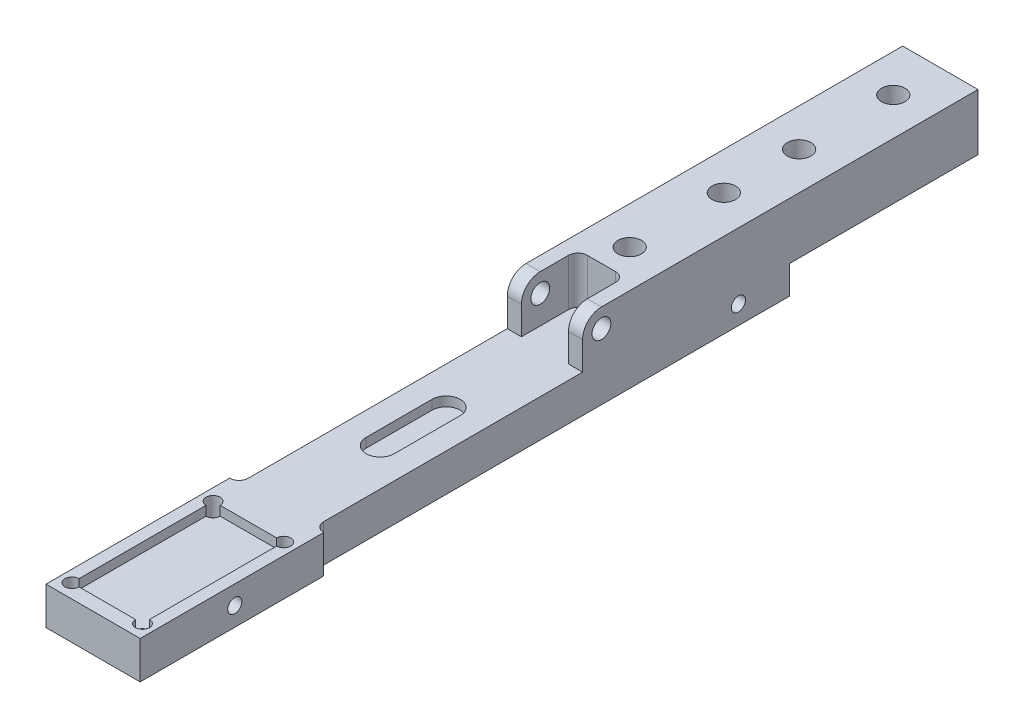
ISO-10303-21;
HEADER;
FILE_DESCRIPTION(('STEP AP214'),'2;1');
FILE_NAME('part.step','',(''),(''),'','','');
FILE_SCHEMA(('AUTOMOTIVE_DESIGN { 1 0 10303 214 1 1 1 1 }'));
ENDSEC;
DATA;
#1=APPLICATION_CONTEXT('core data for automotive mechanical design processes');
#2=APPLICATION_PROTOCOL_DEFINITION('international standard','automotive_design',2000,#1);
#3=PRODUCT_CONTEXT('',#1,'mechanical');
#4=PRODUCT('Part','Part','',(#3));
#5=PRODUCT_RELATED_PRODUCT_CATEGORY('part','',(#4));
#6=PRODUCT_DEFINITION_FORMATION('','',#4);
#7=PRODUCT_DEFINITION_CONTEXT('part definition',#1,'design');
#8=PRODUCT_DEFINITION('design','',#6,#7);
#9=PRODUCT_DEFINITION_SHAPE('','',#8);
#10=(LENGTH_UNIT() NAMED_UNIT(*) SI_UNIT(.MILLI.,.METRE.));
#11=(NAMED_UNIT(*) PLANE_ANGLE_UNIT() SI_UNIT($,.RADIAN.));
#12=(NAMED_UNIT(*) SI_UNIT($,.STERADIAN.) SOLID_ANGLE_UNIT());
#13=UNCERTAINTY_MEASURE_WITH_UNIT(LENGTH_MEASURE(1.E-05),#10,'distance_accuracy_value','');
#14=(GEOMETRIC_REPRESENTATION_CONTEXT(3) GLOBAL_UNCERTAINTY_ASSIGNED_CONTEXT((#13)) GLOBAL_UNIT_ASSIGNED_CONTEXT((#10,
#11,#12)) REPRESENTATION_CONTEXT('',''));
#15=CARTESIAN_POINT('',(0.,0.,0.));
#16=DIRECTION('',(0.,0.,1.));
#17=DIRECTION('',(1.,0.,0.));
#18=AXIS2_PLACEMENT_3D('',#15,#16,#17);
#19=CARTESIAN_POINT('',(10.,-8.,-40.));
#20=DIRECTION('',(0.,0.,1.));
#21=DIRECTION('',(1.,0.,0.));
#22=AXIS2_PLACEMENT_3D('',#19,#20,#21);
#23=PLANE('',#22);
#24=DIRECTION('',(-1.,0.,0.));
#25=VECTOR('',#24,1.);
#26=CARTESIAN_POINT('',(-8.,-8.,-40.));
#27=LINE('',#26,#25);
#28=CARTESIAN_POINT('',(8.,-8.,-40.));
#29=VERTEX_POINT('',#28);
#30=CARTESIAN_POINT('',(-8.,-8.,-40.));
#31=VERTEX_POINT('',#30);
#32=EDGE_CURVE('E345',#29,#31,#27,.T.);
#33=ORIENTED_EDGE('',*,*,#32,.F.);
#34=DIRECTION('',(0.,-1.,0.));
#35=VECTOR('',#34,1.);
#36=CARTESIAN_POINT('',(8.,-8.,-40.));
#37=LINE('',#36,#35);
#38=CARTESIAN_POINT('',(8.,-14.,-40.));
#39=VERTEX_POINT('',#38);
#40=EDGE_CURVE('E365',#29,#39,#37,.T.);
#41=ORIENTED_EDGE('',*,*,#40,.T.);
#42=DIRECTION('',(-1.,0.,0.));
#43=VECTOR('',#42,1.);
#44=CARTESIAN_POINT('',(10.,-14.,-40.));
#45=LINE('',#44,#43);
#46=CARTESIAN_POINT('',(-8.,-14.,-40.));
#47=VERTEX_POINT('',#46);
#48=EDGE_CURVE('E501',#39,#47,#45,.T.);
#49=ORIENTED_EDGE('',*,*,#48,.T.);
#50=DIRECTION('',(0.,1.,0.));
#51=VECTOR('',#50,1.);
#52=CARTESIAN_POINT('',(-8.,-8.,-40.));
#53=LINE('',#52,#51);
#54=EDGE_CURVE('E448',#47,#31,#53,.T.);
#55=ORIENTED_EDGE('',*,*,#54,.T.);
#56=EDGE_LOOP('',(#33,#41,#49,#55));
#57=FACE_BOUND('',#56,.T.);
#58=ADVANCED_FACE('F35',(#57),#23,.F.);
#59=CARTESIAN_POINT('',(10.,-8.,4.));
#60=DIRECTION('',(0.,0.,-1.));
#61=DIRECTION('',(-1.,0.,0.));
#62=AXIS2_PLACEMENT_3D('',#59,#60,#61);
#63=PLANE('',#62);
#64=DIRECTION('',(-1.,0.,0.));
#65=VECTOR('',#64,1.);
#66=CARTESIAN_POINT('',(-8.,-6.,4.));
#67=LINE('',#66,#65);
#68=CARTESIAN_POINT('',(8.,-6.,4.));
#69=VERTEX_POINT('',#68);
#70=CARTESIAN_POINT('',(5.,-6.,4.));
#71=VERTEX_POINT('',#70);
#72=EDGE_CURVE('E546',#69,#71,#67,.T.);
#73=ORIENTED_EDGE('',*,*,#72,.F.);
#74=DIRECTION('',(0.,-1.,0.));
#75=VECTOR('',#74,1.);
#76=CARTESIAN_POINT('',(8.,-8.,4.));
#77=LINE('',#76,#75);
#78=CARTESIAN_POINT('',(8.,0.,4.));
#79=VERTEX_POINT('',#78);
#80=EDGE_CURVE('E461',#79,#69,#77,.T.);
#81=ORIENTED_EDGE('',*,*,#80,.F.);
#82=DIRECTION('',(-1.,0.,0.));
#83=VECTOR('',#82,1.);
#84=CARTESIAN_POINT('',(10.,0.,4.));
#85=LINE('',#84,#83);
#86=CARTESIAN_POINT('',(5.,0.,4.));
#87=VERTEX_POINT('',#86);
#88=EDGE_CURVE('E481',#79,#87,#85,.T.);
#89=ORIENTED_EDGE('',*,*,#88,.T.);
#90=DIRECTION('',(0.,1.,0.));
#91=VECTOR('',#90,1.);
#92=CARTESIAN_POINT('',(5.,-6.,4.));
#93=LINE('',#92,#91);
#94=EDGE_CURVE('E545',#71,#87,#93,.T.);
#95=ORIENTED_EDGE('',*,*,#94,.F.);
#96=EDGE_LOOP('',(#73,#81,#89,#95));
#97=FACE_BOUND('',#96,.T.);
#98=ADVANCED_FACE('F435',(#97),#63,.F.);
#99=CARTESIAN_POINT('',(-5.,-6.,4.));
#100=VERTEX_POINT('',#99);
#101=CARTESIAN_POINT('',(-8.,-6.,4.));
#102=VERTEX_POINT('',#101);
#103=EDGE_CURVE('E597',#100,#102,#67,.T.);
#104=ORIENTED_EDGE('',*,*,#103,.F.);
#105=DIRECTION('',(0.,1.,0.));
#106=VECTOR('',#105,1.);
#107=CARTESIAN_POINT('',(-5.,-6.,4.));
#108=LINE('',#107,#106);
#109=CARTESIAN_POINT('',(-5.,0.,4.));
#110=VERTEX_POINT('',#109);
#111=EDGE_CURVE('E553',#100,#110,#108,.T.);
#112=ORIENTED_EDGE('',*,*,#111,.T.);
#113=CARTESIAN_POINT('',(-8.,0.,4.));
#114=VERTEX_POINT('',#113);
#115=EDGE_CURVE('E535',#110,#114,#85,.T.);
#116=ORIENTED_EDGE('',*,*,#115,.T.);
#117=DIRECTION('',(0.,1.,0.));
#118=VECTOR('',#117,1.);
#119=CARTESIAN_POINT('',(-8.,-8.,4.));
#120=LINE('',#119,#118);
#121=EDGE_CURVE('E482',#102,#114,#120,.T.);
#122=ORIENTED_EDGE('',*,*,#121,.F.);
#123=EDGE_LOOP('',(#104,#112,#116,#122));
#124=FACE_BOUND('',#123,.T.);
#125=ADVANCED_FACE('F442',(#124),#63,.F.);
#126=CARTESIAN_POINT('',(10.,0.,0.));
#127=DIRECTION('',(-1.,0.,0.));
#128=DIRECTION('',(0.,0.,1.));
#129=AXIS2_PLACEMENT_3D('',#126,#127,#128);
#130=CYLINDRICAL_SURFACE('',#129,4.);
#131=ORIENTED_EDGE('',*,*,#115,.F.);
#132=CARTESIAN_POINT('',(-5.,0.,0.));
#133=DIRECTION('',(-1.,0.,0.));
#134=DIRECTION('',(0.,0.,1.));
#135=AXIS2_PLACEMENT_3D('',#132,#133,#134);
#136=CIRCLE('',#135,4.);
#137=CARTESIAN_POINT('',(-5.,4.,0.));
#138=VERTEX_POINT('',#137);
#139=EDGE_CURVE('E525',#110,#138,#136,.T.);
#140=ORIENTED_EDGE('',*,*,#139,.T.);
#141=DIRECTION('',(-1.,0.,0.));
#142=VECTOR('',#141,1.);
#143=CARTESIAN_POINT('',(10.,4.,0.));
#144=LINE('',#143,#142);
#145=CARTESIAN_POINT('',(-8.,4.,0.));
#146=VERTEX_POINT('',#145);
#147=EDGE_CURVE('E490',#138,#146,#144,.T.);
#148=ORIENTED_EDGE('',*,*,#147,.T.);
#149=CARTESIAN_POINT('',(-8.,0.,0.));
#150=DIRECTION('',(1.,0.,0.));
#151=DIRECTION('',(0.,0.,-1.));
#152=AXIS2_PLACEMENT_3D('',#149,#150,#151);
#153=CIRCLE('',#152,4.);
#154=EDGE_CURVE('E513',#146,#114,#153,.T.);
#155=ORIENTED_EDGE('',*,*,#154,.T.);
#156=EDGE_LOOP('',(#131,#140,#148,#155));
#157=FACE_BOUND('',#156,.T.);
#158=ADVANCED_FACE('F640',(#157),#130,.T.);
#159=CARTESIAN_POINT('',(10.,0.,0.));
#160=DIRECTION('',(-1.,0.,0.));
#161=DIRECTION('',(0.,0.,1.));
#162=AXIS2_PLACEMENT_3D('',#159,#160,#161);
#163=CYLINDRICAL_SURFACE('',#162,2.);
#164=CARTESIAN_POINT('',(-5.,0.,0.));
#165=DIRECTION('',(-1.,0.,0.));
#166=DIRECTION('',(0.,0.,1.));
#167=AXIS2_PLACEMENT_3D('',#164,#165,#166);
#168=CIRCLE('',#167,2.);
#169=CARTESIAN_POINT('',(-5.,0.,2.));
#170=VERTEX_POINT('',#169);
#171=EDGE_CURVE('E522',#170,#170,#168,.T.);
#172=ORIENTED_EDGE('',*,*,#171,.F.);
#173=EDGE_LOOP('',(#172));
#174=FACE_BOUND('',#173,.T.);
#175=CARTESIAN_POINT('',(-8.,0.,0.));
#176=DIRECTION('',(1.,0.,0.));
#177=DIRECTION('',(0.,0.,-1.));
#178=AXIS2_PLACEMENT_3D('',#175,#176,#177);
#179=CIRCLE('',#178,2.);
#180=CARTESIAN_POINT('',(-8.,0.,-2.));
#181=VERTEX_POINT('',#180);
#182=EDGE_CURVE('E510',#181,#181,#179,.T.);
#183=ORIENTED_EDGE('',*,*,#182,.F.);
#184=EDGE_LOOP('',(#183));
#185=FACE_BOUND('',#184,.T.);
#186=ADVANCED_FACE('F669',(#174,#185),#163,.F.);
#187=CARTESIAN_POINT('',(10.,-8.00000000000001,100.));
#188=DIRECTION('',(0.,0.,-1.));
#189=DIRECTION('',(-1.,0.,0.));
#190=AXIS2_PLACEMENT_3D('',#187,#188,#189);
#191=PLANE('',#190);
#192=DIRECTION('',(0.,-1.,0.));
#193=VECTOR('',#192,1.);
#194=CARTESIAN_POINT('',(-10.,-8.00000000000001,100.));
#195=LINE('',#194,#193);
#196=CARTESIAN_POINT('',(-10.,-6.,100.));
#197=VERTEX_POINT('',#196);
#198=CARTESIAN_POINT('',(-10.,-14.,100.));
#199=VERTEX_POINT('',#198);
#200=EDGE_CURVE('E489',#197,#199,#195,.T.);
#201=ORIENTED_EDGE('',*,*,#200,.T.);
#202=DIRECTION('',(-1.,0.,0.));
#203=VECTOR('',#202,1.);
#204=CARTESIAN_POINT('',(10.,-14.,100.));
#205=LINE('',#204,#203);
#206=CARTESIAN_POINT('',(10.,-14.,100.));
#207=VERTEX_POINT('',#206);
#208=EDGE_CURVE('E506',#207,#199,#205,.T.);
#209=ORIENTED_EDGE('',*,*,#208,.F.);
#210=DIRECTION('',(0.,-1.,0.));
#211=VECTOR('',#210,1.);
#212=CARTESIAN_POINT('',(10.,-8.00000000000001,100.));
#213=LINE('',#212,#211);
#214=CARTESIAN_POINT('',(10.,-6.,100.));
#215=VERTEX_POINT('',#214);
#216=EDGE_CURVE('E497',#215,#207,#213,.T.);
#217=ORIENTED_EDGE('',*,*,#216,.F.);
#218=DIRECTION('',(-1.,0.,0.));
#219=VECTOR('',#218,1.);
#220=CARTESIAN_POINT('',(-10.,-6.,100.));
#221=LINE('',#220,#219);
#222=EDGE_CURVE('E604',#215,#197,#221,.T.);
#223=ORIENTED_EDGE('',*,*,#222,.T.);
#224=EDGE_LOOP('',(#201,#209,#217,#223));
#225=FACE_BOUND('',#224,.T.);
#226=ADVANCED_FACE('F667',(#225),#191,.F.);
#227=CARTESIAN_POINT('',(10.,-14.,-40.));
#228=DIRECTION('',(0.,1.,0.));
#229=DIRECTION('',(0.,0.,1.));
#230=AXIS2_PLACEMENT_3D('',#227,#228,#229);
#231=PLANE('',#230);
#232=CARTESIAN_POINT('',(0.,-14.,-14.));
#233=DIRECTION('',(0.,-1.,0.));
#234=DIRECTION('',(0.,0.,-1.));
#235=AXIS2_PLACEMENT_3D('',#232,#233,#234);
#236=CIRCLE('',#235,2.5);
#237=CARTESIAN_POINT('',(0.,-14.,-16.5));
#238=VERTEX_POINT('',#237);
#239=EDGE_CURVE('E810',#238,#238,#236,.T.);
#240=ORIENTED_EDGE('',*,*,#239,.F.);
#241=EDGE_LOOP('',(#240));
#242=FACE_BOUND('',#241,.T.);
#243=CARTESIAN_POINT('',(0.,-14.,-34.));
#244=DIRECTION('',(0.,-1.,0.));
#245=DIRECTION('',(0.,0.,-1.));
#246=AXIS2_PLACEMENT_3D('',#243,#244,#245);
#247=CIRCLE('',#246,2.5);
#248=CARTESIAN_POINT('',(0.,-14.,-36.5));
#249=VERTEX_POINT('',#248);
#250=EDGE_CURVE('E269',#249,#249,#247,.T.);
#251=ORIENTED_EDGE('',*,*,#250,.F.);
#252=EDGE_LOOP('',(#251));
#253=FACE_BOUND('',#252,.T.);
#254=CARTESIAN_POINT('',(-7.5,-14.,96.9999999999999));
#255=DIRECTION('',(0.,1.,0.));
#256=DIRECTION('',(0.,0.,1.));
#257=AXIS2_PLACEMENT_3D('',#254,#255,#256);
#258=CIRCLE('',#257,1.5);
#259=CARTESIAN_POINT('',(-7.5,-14.,98.4999999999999));
#260=VERTEX_POINT('',#259);
#261=EDGE_CURVE('E324',#260,#260,#258,.T.);
#262=ORIENTED_EDGE('',*,*,#261,.T.);
#263=EDGE_LOOP('',(#262));
#264=FACE_BOUND('',#263,.T.);
#265=CARTESIAN_POINT('',(-7.49999999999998,-14.,67.));
#266=DIRECTION('',(0.,1.,0.));
#267=DIRECTION('',(0.,0.,1.));
#268=AXIS2_PLACEMENT_3D('',#265,#266,#267);
#269=CIRCLE('',#268,1.5);
#270=CARTESIAN_POINT('',(-7.49999999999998,-14.,68.5));
#271=VERTEX_POINT('',#270);
#272=EDGE_CURVE('E330',#271,#271,#269,.T.);
#273=ORIENTED_EDGE('',*,*,#272,.T.);
#274=EDGE_LOOP('',(#273));
#275=FACE_BOUND('',#274,.T.);
#276=CARTESIAN_POINT('',(7.5,-14.,67.));
#277=DIRECTION('',(0.,1.,0.));
#278=DIRECTION('',(0.,0.,1.));
#279=AXIS2_PLACEMENT_3D('',#276,#277,#278);
#280=CIRCLE('',#279,1.5);
#281=CARTESIAN_POINT('',(7.5,-14.,68.5));
#282=VERTEX_POINT('',#281);
#283=EDGE_CURVE('E336',#282,#282,#280,.T.);
#284=ORIENTED_EDGE('',*,*,#283,.T.);
#285=EDGE_LOOP('',(#284));
#286=FACE_BOUND('',#285,.T.);
#287=CARTESIAN_POINT('',(7.5,-14.,97.));
#288=DIRECTION('',(0.,1.,0.));
#289=DIRECTION('',(0.,0.,1.));
#290=AXIS2_PLACEMENT_3D('',#287,#288,#289);
#291=CIRCLE('',#290,1.5);
#292=CARTESIAN_POINT('',(7.5,-14.,98.5));
#293=VERTEX_POINT('',#292);
#294=EDGE_CURVE('E342',#293,#293,#291,.T.);
#295=ORIENTED_EDGE('',*,*,#294,.T.);
#296=EDGE_LOOP('',(#295));
#297=FACE_BOUND('',#296,.T.);
#298=CARTESIAN_POINT('',(-10.,-14.,59.));
#299=DIRECTION('',(0.,1.,0.));
#300=DIRECTION('',(0.,0.,1.));
#301=AXIS2_PLACEMENT_3D('',#298,#299,#300);
#302=CIRCLE('',#301,2.);
#303=CARTESIAN_POINT('',(-9.99999999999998,-14.,61.));
#304=VERTEX_POINT('',#303);
#305=CARTESIAN_POINT('',(-8.,-14.,59.));
#306=VERTEX_POINT('',#305);
#307=EDGE_CURVE('E359',#304,#306,#302,.T.);
#308=ORIENTED_EDGE('',*,*,#307,.T.);
#309=DIRECTION('',(0.,0.,-1.));
#310=VECTOR('',#309,1.);
#311=CARTESIAN_POINT('',(-8.,-14.,-40.));
#312=LINE('',#311,#310);
#313=EDGE_CURVE('E620',#306,#47,#312,.T.);
#314=ORIENTED_EDGE('',*,*,#313,.T.);
#315=ORIENTED_EDGE('',*,*,#48,.F.);
#316=DIRECTION('',(0.,0.,1.));
#317=VECTOR('',#316,1.);
#318=CARTESIAN_POINT('',(8.,-14.,-40.));
#319=LINE('',#318,#317);
#320=CARTESIAN_POINT('',(8.,-14.,59.));
#321=VERTEX_POINT('',#320);
#322=EDGE_CURVE('E458',#39,#321,#319,.T.);
#323=ORIENTED_EDGE('',*,*,#322,.T.);
#324=CARTESIAN_POINT('',(10.,-14.,59.));
#325=DIRECTION('',(0.,1.,0.));
#326=DIRECTION('',(0.,0.,1.));
#327=AXIS2_PLACEMENT_3D('',#324,#325,#326);
#328=CIRCLE('',#327,2.);
#329=CARTESIAN_POINT('',(10.,-14.,61.));
#330=VERTEX_POINT('',#329);
#331=EDGE_CURVE('E611',#321,#330,#328,.T.);
#332=ORIENTED_EDGE('',*,*,#331,.T.);
#333=DIRECTION('',(0.,0.,-1.));
#334=VECTOR('',#333,1.);
#335=CARTESIAN_POINT('',(10.,-14.,-40.));
#336=LINE('',#335,#334);
#337=EDGE_CURVE('E499',#207,#330,#336,.T.);
#338=ORIENTED_EDGE('',*,*,#337,.F.);
#339=ORIENTED_EDGE('',*,*,#208,.T.);
#340=DIRECTION('',(0.,0.,-1.));
#341=VECTOR('',#340,1.);
#342=CARTESIAN_POINT('',(-10.,-14.,-40.));
#343=LINE('',#342,#341);
#344=EDGE_CURVE('E492',#199,#304,#343,.T.);
#345=ORIENTED_EDGE('',*,*,#344,.T.);
#346=EDGE_LOOP('',(#308,#314,#315,#323,#332,#338,#339,#345));
#347=FACE_BOUND('',#346,.T.);
#348=ADVANCED_FACE('F626',(#242,#253,#264,#275,#286,#297,#347),#231,.F.);
#349=CARTESIAN_POINT('',(10.,0.,0.));
#350=DIRECTION('',(-1.,0.,0.));
#351=DIRECTION('',(0.,0.,1.));
#352=AXIS2_PLACEMENT_3D('',#349,#350,#351);
#353=PLANE('',#352);
#354=CARTESIAN_POINT('',(10.,-10.,79.9));
#355=DIRECTION('',(1.,0.,0.));
#356=DIRECTION('',(0.,0.,-1.));
#357=AXIS2_PLACEMENT_3D('',#354,#355,#356);
#358=CIRCLE('',#357,1.5);
#359=CARTESIAN_POINT('',(10.,-10.,78.4));
#360=VERTEX_POINT('',#359);
#361=EDGE_CURVE('E790',#360,#360,#358,.T.);
#362=ORIENTED_EDGE('',*,*,#361,.F.);
#363=EDGE_LOOP('',(#362));
#364=FACE_BOUND('',#363,.T.);
#365=ORIENTED_EDGE('',*,*,#337,.T.);
#366=DIRECTION('',(0.,1.,0.));
#367=VECTOR('',#366,1.);
#368=CARTESIAN_POINT('',(10.,-14.,61.));
#369=LINE('',#368,#367);
#370=CARTESIAN_POINT('',(10.,-5.99999999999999,61.));
#371=VERTEX_POINT('',#370);
#372=EDGE_CURVE('E607',#330,#371,#369,.T.);
#373=ORIENTED_EDGE('',*,*,#372,.T.);
#374=DIRECTION('',(0.,0.,-1.));
#375=VECTOR('',#374,1.);
#376=CARTESIAN_POINT('',(10.,-6.,100.));
#377=LINE('',#376,#375);
#378=EDGE_CURVE('E598',#215,#371,#377,.T.);
#379=ORIENTED_EDGE('',*,*,#378,.F.);
#380=ORIENTED_EDGE('',*,*,#216,.T.);
#381=EDGE_LOOP('',(#365,#373,#379,#380));
#382=FACE_BOUND('',#381,.T.);
#383=ADVANCED_FACE('F663',(#364,#382),#353,.F.);
#384=CARTESIAN_POINT('',(-10.,0.,0.));
#385=DIRECTION('',(-1.,0.,0.));
#386=DIRECTION('',(0.,0.,1.));
#387=AXIS2_PLACEMENT_3D('',#384,#385,#386);
#388=PLANE('',#387);
#389=DIRECTION('',(0.,1.,0.));
#390=VECTOR('',#389,1.);
#391=CARTESIAN_POINT('',(-9.99999999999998,-14.,61.));
#392=LINE('',#391,#390);
#393=CARTESIAN_POINT('',(-9.99999999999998,-6.,61.));
#394=VERTEX_POINT('',#393);
#395=EDGE_CURVE('E618',#304,#394,#392,.T.);
#396=ORIENTED_EDGE('',*,*,#395,.F.);
#397=ORIENTED_EDGE('',*,*,#344,.F.);
#398=ORIENTED_EDGE('',*,*,#200,.F.);
#399=DIRECTION('',(0.,0.,-1.));
#400=VECTOR('',#399,1.);
#401=CARTESIAN_POINT('',(-10.,-6.,100.));
#402=LINE('',#401,#400);
#403=EDGE_CURVE('E601',#197,#394,#402,.T.);
#404=ORIENTED_EDGE('',*,*,#403,.T.);
#405=EDGE_LOOP('',(#396,#397,#398,#404));
#406=FACE_BOUND('',#405,.T.);
#407=ADVANCED_FACE('F633',(#406),#388,.T.);
#408=CARTESIAN_POINT('',(10.,4.,0.));
#409=DIRECTION('',(0.,-1.,0.));
#410=DIRECTION('',(0.,0.,-1.));
#411=AXIS2_PLACEMENT_3D('',#408,#409,#410);
#412=PLANE('',#411);
#413=CARTESIAN_POINT('',(0.,4.00000000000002,-50.));
#414=DIRECTION('',(0.,-1.,0.));
#415=DIRECTION('',(1.,0.,0.));
#416=AXIS2_PLACEMENT_3D('',#413,#414,#415);
#417=CIRCLE('',#416,2.5);
#418=CARTESIAN_POINT('',(2.50000000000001,4.00000000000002,-50.));
#419=VERTEX_POINT('',#418);
#420=EDGE_CURVE('E801',#419,#419,#417,.T.);
#421=ORIENTED_EDGE('',*,*,#420,.T.);
#422=EDGE_LOOP('',(#421));
#423=FACE_BOUND('',#422,.T.);
#424=CARTESIAN_POINT('',(0.,4.00000000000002,-70.));
#425=DIRECTION('',(0.,-1.,0.));
#426=DIRECTION('',(1.,0.,0.));
#427=AXIS2_PLACEMENT_3D('',#424,#425,#426);
#428=CIRCLE('',#427,2.5);
#429=CARTESIAN_POINT('',(2.50000000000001,4.00000000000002,-70.));
#430=VERTEX_POINT('',#429);
#431=EDGE_CURVE('E807',#430,#430,#428,.T.);
#432=ORIENTED_EDGE('',*,*,#431,.T.);
#433=EDGE_LOOP('',(#432));
#434=FACE_BOUND('',#433,.T.);
#435=CARTESIAN_POINT('',(0.,4.00000000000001,-14.));
#436=DIRECTION('',(0.,-1.,0.));
#437=DIRECTION('',(0.,0.,-1.));
#438=AXIS2_PLACEMENT_3D('',#435,#436,#437);
#439=CIRCLE('',#438,2.5);
#440=CARTESIAN_POINT('',(0.,4.00000000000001,-16.5));
#441=VERTEX_POINT('',#440);
#442=EDGE_CURVE('E813',#441,#441,#439,.T.);
#443=ORIENTED_EDGE('',*,*,#442,.T.);
#444=EDGE_LOOP('',(#443));
#445=FACE_BOUND('',#444,.T.);
#446=CARTESIAN_POINT('',(0.,4.00000000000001,-34.));
#447=DIRECTION('',(0.,-1.,0.));
#448=DIRECTION('',(0.,0.,-1.));
#449=AXIS2_PLACEMENT_3D('',#446,#447,#448);
#450=CIRCLE('',#449,2.5);
#451=CARTESIAN_POINT('',(0.,4.00000000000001,-36.5));
#452=VERTEX_POINT('',#451);
#453=EDGE_CURVE('E276',#452,#452,#450,.T.);
#454=ORIENTED_EDGE('',*,*,#453,.T.);
#455=EDGE_LOOP('',(#454));
#456=FACE_BOUND('',#455,.T.);
#457=ORIENTED_EDGE('',*,*,#147,.F.);
#458=DIRECTION('',(0.,0.,1.));
#459=VECTOR('',#458,1.);
#460=CARTESIAN_POINT('',(-5.,4.,4.));
#461=LINE('',#460,#459);
#462=CARTESIAN_POINT('',(-5.,4.,-6.));
#463=VERTEX_POINT('',#462);
#464=EDGE_CURVE('E576',#463,#138,#461,.T.);
#465=ORIENTED_EDGE('',*,*,#464,.F.);
#466=CARTESIAN_POINT('',(-3.,4.,-6.));
#467=DIRECTION('',(0.,1.,0.));
#468=DIRECTION('',(0.,0.,-1.));
#469=AXIS2_PLACEMENT_3D('',#466,#467,#468);
#470=CIRCLE('',#469,2.);
#471=CARTESIAN_POINT('',(-3.,4.,-8.));
#472=VERTEX_POINT('',#471);
#473=EDGE_CURVE('E565',#472,#463,#470,.T.);
#474=ORIENTED_EDGE('',*,*,#473,.F.);
#475=DIRECTION('',(-1.,0.,0.));
#476=VECTOR('',#475,1.);
#477=CARTESIAN_POINT('',(-3.,4.,-8.));
#478=LINE('',#477,#476);
#479=CARTESIAN_POINT('',(3.,4.,-8.));
#480=VERTEX_POINT('',#479);
#481=EDGE_CURVE('E569',#480,#472,#478,.T.);
#482=ORIENTED_EDGE('',*,*,#481,.F.);
#483=CARTESIAN_POINT('',(3.,4.,-6.));
#484=DIRECTION('',(0.,1.,0.));
#485=DIRECTION('',(0.,0.,1.));
#486=AXIS2_PLACEMENT_3D('',#483,#484,#485);
#487=CIRCLE('',#486,2.);
#488=CARTESIAN_POINT('',(5.,4.,-6.));
#489=VERTEX_POINT('',#488);
#490=EDGE_CURVE('E572',#489,#480,#487,.T.);
#491=ORIENTED_EDGE('',*,*,#490,.F.);
#492=DIRECTION('',(0.,0.,-1.));
#493=VECTOR('',#492,1.);
#494=CARTESIAN_POINT('',(5.,4.,4.));
#495=LINE('',#494,#493);
#496=CARTESIAN_POINT('',(5.,4.,0.));
#497=VERTEX_POINT('',#496);
#498=EDGE_CURVE('E488',#497,#489,#495,.T.);
#499=ORIENTED_EDGE('',*,*,#498,.F.);
#500=CARTESIAN_POINT('',(8.,4.,0.));
#501=VERTEX_POINT('',#500);
#502=EDGE_CURVE('E479',#501,#497,#144,.T.);
#503=ORIENTED_EDGE('',*,*,#502,.F.);
#504=DIRECTION('',(0.,0.,1.));
#505=VECTOR('',#504,1.);
#506=CARTESIAN_POINT('',(8.,4.,-40.));
#507=LINE('',#506,#505);
#508=CARTESIAN_POINT('',(8.,4.,-80.));
#509=VERTEX_POINT('',#508);
#510=EDGE_CURVE('E460',#509,#501,#507,.T.);
#511=ORIENTED_EDGE('',*,*,#510,.F.);
#512=DIRECTION('',(1.,0.,0.));
#513=VECTOR('',#512,1.);
#514=CARTESIAN_POINT('',(-8.,4.,-80.));
#515=LINE('',#514,#513);
#516=CARTESIAN_POINT('',(-8.,4.,-80.));
#517=VERTEX_POINT('',#516);
#518=EDGE_CURVE('E349',#517,#509,#515,.T.);
#519=ORIENTED_EDGE('',*,*,#518,.F.);
#520=DIRECTION('',(0.,0.,1.));
#521=VECTOR('',#520,1.);
#522=CARTESIAN_POINT('',(-8.,4.,-40.));
#523=LINE('',#522,#521);
#524=EDGE_CURVE('E514',#517,#146,#523,.T.);
#525=ORIENTED_EDGE('',*,*,#524,.T.);
#526=EDGE_LOOP('',(#457,#465,#474,#482,#491,#499,#503,#511,#519,#525));
#527=FACE_BOUND('',#526,.T.);
#528=ADVANCED_FACE('F486',(#423,#434,#445,#456,#527),#412,.F.);
#529=ORIENTED_EDGE('',*,*,#502,.T.);
#530=CARTESIAN_POINT('',(5.,0.,0.));
#531=DIRECTION('',(1.,0.,0.));
#532=DIRECTION('',(0.,0.,-1.));
#533=AXIS2_PLACEMENT_3D('',#530,#531,#532);
#534=CIRCLE('',#533,4.);
#535=EDGE_CURVE('E520',#497,#87,#534,.T.);
#536=ORIENTED_EDGE('',*,*,#535,.T.);
#537=ORIENTED_EDGE('',*,*,#88,.F.);
#538=CARTESIAN_POINT('',(8.,0.,0.));
#539=DIRECTION('',(-1.,0.,0.));
#540=DIRECTION('',(0.,0.,1.));
#541=AXIS2_PLACEMENT_3D('',#538,#539,#540);
#542=CIRCLE('',#541,4.);
#543=EDGE_CURVE('E468',#79,#501,#542,.T.);
#544=ORIENTED_EDGE('',*,*,#543,.T.);
#545=EDGE_LOOP('',(#529,#536,#537,#544));
#546=FACE_BOUND('',#545,.T.);
#547=ADVANCED_FACE('F477',(#546),#130,.T.);
#548=CARTESIAN_POINT('',(5.,0.,0.));
#549=DIRECTION('',(1.,0.,0.));
#550=DIRECTION('',(0.,0.,-1.));
#551=AXIS2_PLACEMENT_3D('',#548,#549,#550);
#552=CIRCLE('',#551,2.);
#553=CARTESIAN_POINT('',(5.,0.,-2.));
#554=VERTEX_POINT('',#553);
#555=EDGE_CURVE('E517',#554,#554,#552,.T.);
#556=ORIENTED_EDGE('',*,*,#555,.F.);
#557=EDGE_LOOP('',(#556));
#558=FACE_BOUND('',#557,.T.);
#559=CARTESIAN_POINT('',(8.,0.,0.));
#560=DIRECTION('',(-1.,0.,0.));
#561=DIRECTION('',(0.,0.,1.));
#562=AXIS2_PLACEMENT_3D('',#559,#560,#561);
#563=CIRCLE('',#562,2.);
#564=CARTESIAN_POINT('',(8.,0.,2.));
#565=VERTEX_POINT('',#564);
#566=EDGE_CURVE('E472',#565,#565,#563,.T.);
#567=ORIENTED_EDGE('',*,*,#566,.F.);
#568=EDGE_LOOP('',(#567));
#569=FACE_BOUND('',#568,.T.);
#570=ADVANCED_FACE('F680',(#558,#569),#163,.F.);
#571=CARTESIAN_POINT('',(-8.,-8.,-40.));
#572=DIRECTION('',(1.,0.,0.));
#573=DIRECTION('',(0.,0.,-1.));
#574=AXIS2_PLACEMENT_3D('',#571,#572,#573);
#575=PLANE('',#574);
#576=ORIENTED_EDGE('',*,*,#182,.T.);
#577=EDGE_LOOP('',(#576));
#578=FACE_BOUND('',#577,.T.);
#579=ORIENTED_EDGE('',*,*,#524,.F.);
#580=DIRECTION('',(0.,1.,0.));
#581=VECTOR('',#580,1.);
#582=CARTESIAN_POINT('',(-8.,4.,-80.));
#583=LINE('',#582,#581);
#584=CARTESIAN_POINT('',(-8.,-8.,-80.));
#585=VERTEX_POINT('',#584);
#586=EDGE_CURVE('E346',#585,#517,#583,.T.);
#587=ORIENTED_EDGE('',*,*,#586,.F.);
#588=DIRECTION('',(0.,0.,1.));
#589=VECTOR('',#588,1.);
#590=CARTESIAN_POINT('',(-8.,-8.,-80.));
#591=LINE('',#590,#589);
#592=EDGE_CURVE('E356',#585,#31,#591,.T.);
#593=ORIENTED_EDGE('',*,*,#592,.T.);
#594=ORIENTED_EDGE('',*,*,#54,.F.);
#595=ORIENTED_EDGE('',*,*,#313,.F.);
#596=DIRECTION('',(0.,1.,0.));
#597=VECTOR('',#596,1.);
#598=CARTESIAN_POINT('',(-8.,-14.,59.));
#599=LINE('',#598,#597);
#600=CARTESIAN_POINT('',(-8.,-5.99999999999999,59.));
#601=VERTEX_POINT('',#600);
#602=EDGE_CURVE('E617',#306,#601,#599,.T.);
#603=ORIENTED_EDGE('',*,*,#602,.T.);
#604=DIRECTION('',(0.,0.,-1.));
#605=VECTOR('',#604,1.);
#606=CARTESIAN_POINT('',(-8.,-6.,19.));
#607=LINE('',#606,#605);
#608=EDGE_CURVE('E593',#601,#102,#607,.T.);
#609=ORIENTED_EDGE('',*,*,#608,.T.);
#610=ORIENTED_EDGE('',*,*,#121,.T.);
#611=ORIENTED_EDGE('',*,*,#154,.F.);
#612=EDGE_LOOP('',(#579,#587,#593,#594,#595,#603,#609,#610,#611));
#613=FACE_BOUND('',#612,.T.);
#614=ADVANCED_FACE('F637',(#578,#613),#575,.F.);
#615=CARTESIAN_POINT('',(8.,-8.,-40.));
#616=DIRECTION('',(-1.,0.,0.));
#617=DIRECTION('',(0.,0.,1.));
#618=AXIS2_PLACEMENT_3D('',#615,#616,#617);
#619=PLANE('',#618);
#620=CARTESIAN_POINT('',(8.,-10.,-29.1));
#621=DIRECTION('',(1.,0.,0.));
#622=DIRECTION('',(0.,0.,-1.));
#623=AXIS2_PLACEMENT_3D('',#620,#621,#622);
#624=CIRCLE('',#623,1.5);
#625=CARTESIAN_POINT('',(8.,-10.,-30.6));
#626=VERTEX_POINT('',#625);
#627=EDGE_CURVE('E789',#626,#626,#624,.T.);
#628=ORIENTED_EDGE('',*,*,#627,.F.);
#629=EDGE_LOOP('',(#628));
#630=FACE_BOUND('',#629,.T.);
#631=ORIENTED_EDGE('',*,*,#566,.T.);
#632=EDGE_LOOP('',(#631));
#633=FACE_BOUND('',#632,.T.);
#634=ORIENTED_EDGE('',*,*,#80,.T.);
#635=DIRECTION('',(0.,0.,-1.));
#636=VECTOR('',#635,1.);
#637=CARTESIAN_POINT('',(8.,-6.,19.));
#638=LINE('',#637,#636);
#639=CARTESIAN_POINT('',(8.,-6.,59.));
#640=VERTEX_POINT('',#639);
#641=EDGE_CURVE('E578',#640,#69,#638,.T.);
#642=ORIENTED_EDGE('',*,*,#641,.F.);
#643=DIRECTION('',(0.,1.,0.));
#644=VECTOR('',#643,1.);
#645=CARTESIAN_POINT('',(8.,-14.,59.));
#646=LINE('',#645,#644);
#647=EDGE_CURVE('E608',#321,#640,#646,.T.);
#648=ORIENTED_EDGE('',*,*,#647,.F.);
#649=ORIENTED_EDGE('',*,*,#322,.F.);
#650=ORIENTED_EDGE('',*,*,#40,.F.);
#651=DIRECTION('',(0.,0.,1.));
#652=VECTOR('',#651,1.);
#653=CARTESIAN_POINT('',(8.,-8.,-80.));
#654=LINE('',#653,#652);
#655=CARTESIAN_POINT('',(8.,-8.,-80.));
#656=VERTEX_POINT('',#655);
#657=EDGE_CURVE('E370',#656,#29,#654,.T.);
#658=ORIENTED_EDGE('',*,*,#657,.F.);
#659=DIRECTION('',(0.,-1.,0.));
#660=VECTOR('',#659,1.);
#661=CARTESIAN_POINT('',(8.,4.,-80.));
#662=LINE('',#661,#660);
#663=EDGE_CURVE('E352',#509,#656,#662,.T.);
#664=ORIENTED_EDGE('',*,*,#663,.F.);
#665=ORIENTED_EDGE('',*,*,#510,.T.);
#666=ORIENTED_EDGE('',*,*,#543,.F.);
#667=EDGE_LOOP('',(#634,#642,#648,#649,#650,#658,#664,#665,#666));
#668=FACE_BOUND('',#667,.T.);
#669=ADVANCED_FACE('F454',(#630,#633,#668),#619,.F.);
#670=CARTESIAN_POINT('',(-5.,-6.,4.));
#671=DIRECTION('',(-1.,0.,0.));
#672=DIRECTION('',(0.,0.,1.));
#673=AXIS2_PLACEMENT_3D('',#670,#671,#672);
#674=PLANE('',#673);
#675=ORIENTED_EDGE('',*,*,#171,.T.);
#676=EDGE_LOOP('',(#675));
#677=FACE_BOUND('',#676,.T.);
#678=ORIENTED_EDGE('',*,*,#111,.F.);
#679=DIRECTION('',(0.,0.,1.));
#680=VECTOR('',#679,1.);
#681=CARTESIAN_POINT('',(-5.,-6.,4.));
#682=LINE('',#681,#680);
#683=CARTESIAN_POINT('',(-5.,-6.,-6.));
#684=VERTEX_POINT('',#683);
#685=EDGE_CURVE('E568',#684,#100,#682,.T.);
#686=ORIENTED_EDGE('',*,*,#685,.F.);
#687=DIRECTION('',(0.,1.,0.));
#688=VECTOR('',#687,1.);
#689=CARTESIAN_POINT('',(-5.,-6.,-6.));
#690=LINE('',#689,#688);
#691=EDGE_CURVE('E521',#684,#463,#690,.T.);
#692=ORIENTED_EDGE('',*,*,#691,.T.);
#693=ORIENTED_EDGE('',*,*,#464,.T.);
#694=ORIENTED_EDGE('',*,*,#139,.F.);
#695=EDGE_LOOP('',(#678,#686,#692,#693,#694));
#696=FACE_BOUND('',#695,.T.);
#697=ADVANCED_FACE('F643',(#677,#696),#674,.F.);
#698=CARTESIAN_POINT('',(5.,-6.,4.));
#699=DIRECTION('',(1.,0.,0.));
#700=DIRECTION('',(0.,0.,-1.));
#701=AXIS2_PLACEMENT_3D('',#698,#699,#700);
#702=PLANE('',#701);
#703=ORIENTED_EDGE('',*,*,#555,.T.);
#704=EDGE_LOOP('',(#703));
#705=FACE_BOUND('',#704,.T.);
#706=ORIENTED_EDGE('',*,*,#498,.T.);
#707=DIRECTION('',(0.,1.,0.));
#708=VECTOR('',#707,1.);
#709=CARTESIAN_POINT('',(5.,-6.,-6.));
#710=LINE('',#709,#708);
#711=CARTESIAN_POINT('',(5.,-6.,-6.));
#712=VERTEX_POINT('',#711);
#713=EDGE_CURVE('E557',#712,#489,#710,.T.);
#714=ORIENTED_EDGE('',*,*,#713,.F.);
#715=DIRECTION('',(0.,0.,-1.));
#716=VECTOR('',#715,1.);
#717=CARTESIAN_POINT('',(5.,-6.,4.));
#718=LINE('',#717,#716);
#719=EDGE_CURVE('E587',#71,#712,#718,.T.);
#720=ORIENTED_EDGE('',*,*,#719,.F.);
#721=ORIENTED_EDGE('',*,*,#94,.T.);
#722=ORIENTED_EDGE('',*,*,#535,.F.);
#723=EDGE_LOOP('',(#706,#714,#720,#721,#722));
#724=FACE_BOUND('',#723,.T.);
#725=ADVANCED_FACE('F657',(#705,#724),#702,.F.);
#726=CARTESIAN_POINT('',(-3.,-6.,-6.));
#727=DIRECTION('',(0.,1.,0.));
#728=DIRECTION('',(0.,0.,1.));
#729=AXIS2_PLACEMENT_3D('',#726,#727,#728);
#730=CYLINDRICAL_SURFACE('',#729,2.);
#731=ORIENTED_EDGE('',*,*,#473,.T.);
#732=ORIENTED_EDGE('',*,*,#691,.F.);
#733=CARTESIAN_POINT('',(-3.,-6.,-6.));
#734=DIRECTION('',(0.,1.,0.));
#735=DIRECTION('',(0.,0.,-1.));
#736=AXIS2_PLACEMENT_3D('',#733,#734,#735);
#737=CIRCLE('',#736,2.);
#738=CARTESIAN_POINT('',(-3.,-6.,-8.));
#739=VERTEX_POINT('',#738);
#740=EDGE_CURVE('E555',#739,#684,#737,.T.);
#741=ORIENTED_EDGE('',*,*,#740,.F.);
#742=DIRECTION('',(0.,1.,0.));
#743=VECTOR('',#742,1.);
#744=CARTESIAN_POINT('',(-3.,-6.,-8.));
#745=LINE('',#744,#743);
#746=EDGE_CURVE('E562',#739,#472,#745,.T.);
#747=ORIENTED_EDGE('',*,*,#746,.T.);
#748=EDGE_LOOP('',(#731,#732,#741,#747));
#749=FACE_BOUND('',#748,.T.);
#750=ADVANCED_FACE('F647',(#749),#730,.F.);
#751=CARTESIAN_POINT('',(-3.,-6.,-8.));
#752=DIRECTION('',(0.,0.,-1.));
#753=DIRECTION('',(0.,1.,0.));
#754=AXIS2_PLACEMENT_3D('',#751,#752,#753);
#755=PLANE('',#754);
#756=ORIENTED_EDGE('',*,*,#481,.T.);
#757=ORIENTED_EDGE('',*,*,#746,.F.);
#758=DIRECTION('',(-1.,0.,0.));
#759=VECTOR('',#758,1.);
#760=CARTESIAN_POINT('',(-3.,-6.,-8.));
#761=LINE('',#760,#759);
#762=CARTESIAN_POINT('',(3.,-6.,-8.));
#763=VERTEX_POINT('',#762);
#764=EDGE_CURVE('E581',#763,#739,#761,.T.);
#765=ORIENTED_EDGE('',*,*,#764,.F.);
#766=DIRECTION('',(0.,1.,0.));
#767=VECTOR('',#766,1.);
#768=CARTESIAN_POINT('',(3.,-6.,-8.));
#769=LINE('',#768,#767);
#770=EDGE_CURVE('E560',#763,#480,#769,.T.);
#771=ORIENTED_EDGE('',*,*,#770,.T.);
#772=EDGE_LOOP('',(#756,#757,#765,#771));
#773=FACE_BOUND('',#772,.T.);
#774=ADVANCED_FACE('F650',(#773),#755,.F.);
#775=CARTESIAN_POINT('',(3.,-6.,-6.));
#776=DIRECTION('',(0.,1.,0.));
#777=DIRECTION('',(0.,0.,1.));
#778=AXIS2_PLACEMENT_3D('',#775,#776,#777);
#779=CYLINDRICAL_SURFACE('',#778,2.);
#780=ORIENTED_EDGE('',*,*,#490,.T.);
#781=ORIENTED_EDGE('',*,*,#770,.F.);
#782=CARTESIAN_POINT('',(3.,-6.,-6.));
#783=DIRECTION('',(0.,1.,0.));
#784=DIRECTION('',(0.,0.,1.));
#785=AXIS2_PLACEMENT_3D('',#782,#783,#784);
#786=CIRCLE('',#785,2.);
#787=EDGE_CURVE('E584',#712,#763,#786,.T.);
#788=ORIENTED_EDGE('',*,*,#787,.F.);
#789=ORIENTED_EDGE('',*,*,#713,.T.);
#790=EDGE_LOOP('',(#780,#781,#788,#789));
#791=FACE_BOUND('',#790,.T.);
#792=ADVANCED_FACE('F654',(#791),#779,.F.);
#793=CARTESIAN_POINT('',(-3.,-6.,-6.));
#794=DIRECTION('',(0.,-1.,0.));
#795=DIRECTION('',(0.,0.,-1.));
#796=AXIS2_PLACEMENT_3D('',#793,#794,#795);
#797=PLANE('',#796);
#798=DIRECTION('',(0.,0.,1.));
#799=VECTOR('',#798,1.);
#800=CARTESIAN_POINT('',(-3.,-6.,25.));
#801=LINE('',#800,#799);
#802=CARTESIAN_POINT('',(-3.,-6.,25.));
#803=VERTEX_POINT('',#802);
#804=CARTESIAN_POINT('',(-3.,-6.,39.));
#805=VERTEX_POINT('',#804);
#806=EDGE_CURVE('E275',#803,#805,#801,.T.);
#807=ORIENTED_EDGE('',*,*,#806,.F.);
#808=CARTESIAN_POINT('',(0.,-6.,25.));
#809=DIRECTION('',(0.,1.,0.));
#810=DIRECTION('',(0.,0.,1.));
#811=AXIS2_PLACEMENT_3D('',#808,#809,#810);
#812=CIRCLE('',#811,3.);
#813=CARTESIAN_POINT('',(3.,-6.,25.));
#814=VERTEX_POINT('',#813);
#815=EDGE_CURVE('E49',#814,#803,#812,.T.);
#816=ORIENTED_EDGE('',*,*,#815,.F.);
#817=DIRECTION('',(0.,0.,-1.));
#818=VECTOR('',#817,1.);
#819=CARTESIAN_POINT('',(3.,-6.,25.));
#820=LINE('',#819,#818);
#821=CARTESIAN_POINT('',(3.00000000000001,-6.,39.));
#822=VERTEX_POINT('',#821);
#823=EDGE_CURVE('E263',#822,#814,#820,.T.);
#824=ORIENTED_EDGE('',*,*,#823,.F.);
#825=CARTESIAN_POINT('',(0.,-6.,39.));
#826=DIRECTION('',(0.,1.,0.));
#827=DIRECTION('',(0.,0.,1.));
#828=AXIS2_PLACEMENT_3D('',#825,#826,#827);
#829=CIRCLE('',#828,3.);
#830=EDGE_CURVE('E266',#805,#822,#829,.T.);
#831=ORIENTED_EDGE('',*,*,#830,.F.);
#832=EDGE_LOOP('',(#807,#816,#824,#831));
#833=FACE_BOUND('',#832,.T.);
#834=CARTESIAN_POINT('',(-7.5,-5.99999999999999,96.9999999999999));
#835=DIRECTION('',(0.,1.,0.));
#836=DIRECTION('',(0.,0.,-1.));
#837=AXIS2_PLACEMENT_3D('',#834,#835,#836);
#838=CIRCLE('',#837,1.5);
#839=CARTESIAN_POINT('',(-7.5,-5.99999999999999,95.4999999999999));
#840=VERTEX_POINT('',#839);
#841=CARTESIAN_POINT('',(-6.,-5.99999999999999,97.));
#842=VERTEX_POINT('',#841);
#843=EDGE_CURVE('E321',#840,#842,#838,.T.);
#844=ORIENTED_EDGE('',*,*,#843,.F.);
#845=DIRECTION('',(0.,0.,1.));
#846=VECTOR('',#845,1.);
#847=CARTESIAN_POINT('',(-7.49999999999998,-5.99999999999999,67.));
#848=LINE('',#847,#846);
#849=CARTESIAN_POINT('',(-7.49999999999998,-5.99999999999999,68.5));
#850=VERTEX_POINT('',#849);
#851=EDGE_CURVE('E282',#850,#840,#848,.T.);
#852=ORIENTED_EDGE('',*,*,#851,.F.);
#853=CARTESIAN_POINT('',(-7.49999999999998,-5.99999999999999,67.));
#854=DIRECTION('',(0.,1.,0.));
#855=DIRECTION('',(0.,0.,-1.));
#856=AXIS2_PLACEMENT_3D('',#853,#854,#855);
#857=CIRCLE('',#856,1.5);
#858=CARTESIAN_POINT('',(-5.99999999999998,-5.99999999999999,67.));
#859=VERTEX_POINT('',#858);
#860=EDGE_CURVE('E327',#859,#850,#857,.T.);
#861=ORIENTED_EDGE('',*,*,#860,.F.);
#862=DIRECTION('',(-1.,0.,0.));
#863=VECTOR('',#862,1.);
#864=CARTESIAN_POINT('',(-7.49999999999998,-5.99999999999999,67.));
#865=LINE('',#864,#863);
#866=CARTESIAN_POINT('',(6.,-5.99999999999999,67.));
#867=VERTEX_POINT('',#866);
#868=EDGE_CURVE('E288',#867,#859,#865,.T.);
#869=ORIENTED_EDGE('',*,*,#868,.F.);
#870=CARTESIAN_POINT('',(7.5,-5.99999999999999,67.));
#871=DIRECTION('',(0.,1.,0.));
#872=DIRECTION('',(0.,0.,1.));
#873=AXIS2_PLACEMENT_3D('',#870,#871,#872);
#874=CIRCLE('',#873,1.5);
#875=CARTESIAN_POINT('',(7.5,-5.99999999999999,68.5));
#876=VERTEX_POINT('',#875);
#877=EDGE_CURVE('E333',#876,#867,#874,.T.);
#878=ORIENTED_EDGE('',*,*,#877,.F.);
#879=DIRECTION('',(0.,0.,-1.));
#880=VECTOR('',#879,1.);
#881=CARTESIAN_POINT('',(7.5,-5.99999999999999,67.));
#882=LINE('',#881,#880);
#883=CARTESIAN_POINT('',(7.5,-5.99999999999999,95.5));
#884=VERTEX_POINT('',#883);
#885=EDGE_CURVE('E301',#884,#876,#882,.T.);
#886=ORIENTED_EDGE('',*,*,#885,.F.);
#887=CARTESIAN_POINT('',(7.5,-5.99999999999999,97.));
#888=DIRECTION('',(0.,1.,0.));
#889=DIRECTION('',(0.,0.,1.));
#890=AXIS2_PLACEMENT_3D('',#887,#888,#889);
#891=CIRCLE('',#890,1.5);
#892=CARTESIAN_POINT('',(6.,-5.99999999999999,97.));
#893=VERTEX_POINT('',#892);
#894=EDGE_CURVE('E339',#893,#884,#891,.T.);
#895=ORIENTED_EDGE('',*,*,#894,.F.);
#896=DIRECTION('',(1.,0.,0.));
#897=VECTOR('',#896,1.);
#898=CARTESIAN_POINT('',(-7.5,-5.99999999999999,97.));
#899=LINE('',#898,#897);
#900=EDGE_CURVE('E299',#842,#893,#899,.T.);
#901=ORIENTED_EDGE('',*,*,#900,.F.);
#902=EDGE_LOOP('',(#844,#852,#861,#869,#878,#886,#895,#901));
#903=FACE_BOUND('',#902,.T.);
#904=ORIENTED_EDGE('',*,*,#608,.F.);
#905=CARTESIAN_POINT('',(-10.,-5.99999999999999,59.));
#906=DIRECTION('',(0.,-1.,0.));
#907=DIRECTION('',(0.,0.,-1.));
#908=AXIS2_PLACEMENT_3D('',#905,#906,#907);
#909=CIRCLE('',#908,2.);
#910=EDGE_CURVE('E380',#601,#394,#909,.T.);
#911=ORIENTED_EDGE('',*,*,#910,.T.);
#912=ORIENTED_EDGE('',*,*,#403,.F.);
#913=ORIENTED_EDGE('',*,*,#222,.F.);
#914=ORIENTED_EDGE('',*,*,#378,.T.);
#915=CARTESIAN_POINT('',(10.,-5.99999999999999,59.));
#916=DIRECTION('',(0.,-1.,0.));
#917=DIRECTION('',(0.,0.,-1.));
#918=AXIS2_PLACEMENT_3D('',#915,#916,#917);
#919=CIRCLE('',#918,2.);
#920=EDGE_CURVE('E509',#371,#640,#919,.T.);
#921=ORIENTED_EDGE('',*,*,#920,.T.);
#922=ORIENTED_EDGE('',*,*,#641,.T.);
#923=ORIENTED_EDGE('',*,*,#72,.T.);
#924=ORIENTED_EDGE('',*,*,#719,.T.);
#925=ORIENTED_EDGE('',*,*,#787,.T.);
#926=ORIENTED_EDGE('',*,*,#764,.T.);
#927=ORIENTED_EDGE('',*,*,#740,.T.);
#928=ORIENTED_EDGE('',*,*,#685,.T.);
#929=ORIENTED_EDGE('',*,*,#103,.T.);
#930=EDGE_LOOP('',(#904,#911,#912,#913,#914,#921,#922,#923,#924,#925,#926,#927,#928,#929));
#931=FACE_BOUND('',#930,.T.);
#932=ADVANCED_FACE('F397',(#833,#903,#931),#797,.F.);
#933=CARTESIAN_POINT('',(10.,-14.,59.));
#934=DIRECTION('',(0.,1.,0.));
#935=DIRECTION('',(0.,0.,1.));
#936=AXIS2_PLACEMENT_3D('',#933,#934,#935);
#937=CYLINDRICAL_SURFACE('',#936,2.);
#938=ORIENTED_EDGE('',*,*,#372,.F.);
#939=ORIENTED_EDGE('',*,*,#331,.F.);
#940=ORIENTED_EDGE('',*,*,#647,.T.);
#941=ORIENTED_EDGE('',*,*,#920,.F.);
#942=EDGE_LOOP('',(#938,#939,#940,#941));
#943=FACE_BOUND('',#942,.T.);
#944=ADVANCED_FACE('F660',(#943),#937,.F.);
#945=CARTESIAN_POINT('',(-10.,-14.,59.));
#946=DIRECTION('',(0.,1.,0.));
#947=DIRECTION('',(0.,0.,1.));
#948=AXIS2_PLACEMENT_3D('',#945,#946,#947);
#949=CYLINDRICAL_SURFACE('',#948,2.);
#950=ORIENTED_EDGE('',*,*,#602,.F.);
#951=ORIENTED_EDGE('',*,*,#307,.F.);
#952=ORIENTED_EDGE('',*,*,#395,.T.);
#953=ORIENTED_EDGE('',*,*,#910,.F.);
#954=EDGE_LOOP('',(#950,#951,#952,#953));
#955=FACE_BOUND('',#954,.T.);
#956=ADVANCED_FACE('F630',(#955),#949,.F.);
#957=CARTESIAN_POINT('',(-8.,-8.,-80.));
#958=DIRECTION('',(0.,1.,0.));
#959=DIRECTION('',(-1.,0.,0.));
#960=AXIS2_PLACEMENT_3D('',#957,#958,#959);
#961=PLANE('',#960);
#962=CARTESIAN_POINT('',(0.,-8.,-50.));
#963=DIRECTION('',(0.,-1.,0.));
#964=DIRECTION('',(1.,0.,0.));
#965=AXIS2_PLACEMENT_3D('',#962,#963,#964);
#966=CIRCLE('',#965,2.5);
#967=CARTESIAN_POINT('',(2.50000000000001,-8.,-50.));
#968=VERTEX_POINT('',#967);
#969=EDGE_CURVE('E799',#968,#968,#966,.T.);
#970=ORIENTED_EDGE('',*,*,#969,.F.);
#971=EDGE_LOOP('',(#970));
#972=FACE_BOUND('',#971,.T.);
#973=CARTESIAN_POINT('',(0.,-8.,-70.));
#974=DIRECTION('',(0.,-1.,0.));
#975=DIRECTION('',(1.,0.,0.));
#976=AXIS2_PLACEMENT_3D('',#973,#974,#975);
#977=CIRCLE('',#976,2.5);
#978=CARTESIAN_POINT('',(2.50000000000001,-8.,-70.));
#979=VERTEX_POINT('',#978);
#980=EDGE_CURVE('E804',#979,#979,#977,.T.);
#981=ORIENTED_EDGE('',*,*,#980,.F.);
#982=EDGE_LOOP('',(#981));
#983=FACE_BOUND('',#982,.T.);
#984=ORIENTED_EDGE('',*,*,#32,.T.);
#985=ORIENTED_EDGE('',*,*,#592,.F.);
#986=DIRECTION('',(-1.,0.,0.));
#987=VECTOR('',#986,1.);
#988=CARTESIAN_POINT('',(-8.,-8.,-80.));
#989=LINE('',#988,#987);
#990=EDGE_CURVE('E354',#656,#585,#989,.T.);
#991=ORIENTED_EDGE('',*,*,#990,.F.);
#992=ORIENTED_EDGE('',*,*,#657,.T.);
#993=EDGE_LOOP('',(#984,#985,#991,#992));
#994=FACE_BOUND('',#993,.T.);
#995=ADVANCED_FACE('F462',(#972,#983,#994),#961,.F.);
#996=CARTESIAN_POINT('',(0.,0.,-80.));
#997=DIRECTION('',(0.,0.,1.));
#998=DIRECTION('',(1.,0.,0.));
#999=AXIS2_PLACEMENT_3D('',#996,#997,#998);
#1000=PLANE('',#999);
#1001=ORIENTED_EDGE('',*,*,#586,.T.);
#1002=ORIENTED_EDGE('',*,*,#518,.T.);
#1003=ORIENTED_EDGE('',*,*,#663,.T.);
#1004=ORIENTED_EDGE('',*,*,#990,.T.);
#1005=EDGE_LOOP('',(#1001,#1002,#1003,#1004));
#1006=FACE_BOUND('',#1005,.T.);
#1007=ADVANCED_FACE('F465',(#1006),#1000,.F.);
#1008=CARTESIAN_POINT('',(7.5,-14.000025,97.));
#1009=DIRECTION('',(0.,1.,0.));
#1010=DIRECTION('',(0.,0.,1.));
#1011=AXIS2_PLACEMENT_3D('',#1008,#1009,#1010);
#1012=CYLINDRICAL_SURFACE('',#1011,1.5);
#1013=ORIENTED_EDGE('',*,*,#894,.T.);
#1014=DIRECTION('',(0.,1.,0.));
#1015=VECTOR('',#1014,1.);
#1016=CARTESIAN_POINT('',(7.5,-14.000025,95.5));
#1017=LINE('',#1016,#1015);
#1018=CARTESIAN_POINT('',(7.5,-7.99999999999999,95.5));
#1019=VERTEX_POINT('',#1018);
#1020=EDGE_CURVE('E318',#884,#1019,#1017,.F.);
#1021=ORIENTED_EDGE('',*,*,#1020,.T.);
#1022=CARTESIAN_POINT('',(7.5,-7.99999999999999,97.));
#1023=DIRECTION('',(0.,1.,0.));
#1024=DIRECTION('',(0.,0.,1.));
#1025=AXIS2_PLACEMENT_3D('',#1022,#1023,#1024);
#1026=CIRCLE('',#1025,1.5);
#1027=CARTESIAN_POINT('',(6.,-7.99999999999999,97.));
#1028=VERTEX_POINT('',#1027);
#1029=EDGE_CURVE('E307',#1028,#1019,#1026,.F.);
#1030=ORIENTED_EDGE('',*,*,#1029,.F.);
#1031=DIRECTION('',(0.,1.,0.));
#1032=VECTOR('',#1031,1.);
#1033=CARTESIAN_POINT('',(6.,-14.000025,97.));
#1034=LINE('',#1033,#1032);
#1035=EDGE_CURVE('E309',#1028,#893,#1034,.T.);
#1036=ORIENTED_EDGE('',*,*,#1035,.T.);
#1037=EDGE_LOOP('',(#1013,#1021,#1030,#1036));
#1038=FACE_BOUND('',#1037,.T.);
#1039=ORIENTED_EDGE('',*,*,#294,.F.);
#1040=EDGE_LOOP('',(#1039));
#1041=FACE_BOUND('',#1040,.T.);
#1042=ADVANCED_FACE('F414',(#1038,#1041),#1012,.F.);
#1043=CARTESIAN_POINT('',(7.5,-14.000025,67.));
#1044=DIRECTION('',(0.,1.,0.));
#1045=DIRECTION('',(0.,0.,1.));
#1046=AXIS2_PLACEMENT_3D('',#1043,#1044,#1045);
#1047=CYLINDRICAL_SURFACE('',#1046,1.5);
#1048=ORIENTED_EDGE('',*,*,#877,.T.);
#1049=DIRECTION('',(0.,1.,0.));
#1050=VECTOR('',#1049,1.);
#1051=CARTESIAN_POINT('',(6.,-14.000025,67.));
#1052=LINE('',#1051,#1050);
#1053=CARTESIAN_POINT('',(6.,-7.99999999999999,67.));
#1054=VERTEX_POINT('',#1053);
#1055=EDGE_CURVE('E315',#867,#1054,#1052,.F.);
#1056=ORIENTED_EDGE('',*,*,#1055,.T.);
#1057=CARTESIAN_POINT('',(7.5,-7.99999999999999,67.));
#1058=DIRECTION('',(0.,1.,0.));
#1059=DIRECTION('',(0.,0.,1.));
#1060=AXIS2_PLACEMENT_3D('',#1057,#1058,#1059);
#1061=CIRCLE('',#1060,1.5);
#1062=CARTESIAN_POINT('',(7.5,-7.99999999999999,68.5));
#1063=VERTEX_POINT('',#1062);
#1064=EDGE_CURVE('E305',#1063,#1054,#1061,.F.);
#1065=ORIENTED_EDGE('',*,*,#1064,.F.);
#1066=DIRECTION('',(0.,1.,0.));
#1067=VECTOR('',#1066,1.);
#1068=CARTESIAN_POINT('',(7.5,-14.000025,68.5));
#1069=LINE('',#1068,#1067);
#1070=EDGE_CURVE('E11',#1063,#876,#1069,.T.);
#1071=ORIENTED_EDGE('',*,*,#1070,.T.);
#1072=EDGE_LOOP('',(#1048,#1056,#1065,#1071));
#1073=FACE_BOUND('',#1072,.T.);
#1074=ORIENTED_EDGE('',*,*,#283,.F.);
#1075=EDGE_LOOP('',(#1074));
#1076=FACE_BOUND('',#1075,.T.);
#1077=ADVANCED_FACE('F422',(#1073,#1076),#1047,.F.);
#1078=CARTESIAN_POINT('',(-7.49999999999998,-14.000025,67.));
#1079=DIRECTION('',(0.,1.,0.));
#1080=DIRECTION('',(0.,0.,1.));
#1081=AXIS2_PLACEMENT_3D('',#1078,#1079,#1080);
#1082=CYLINDRICAL_SURFACE('',#1081,1.5);
#1083=ORIENTED_EDGE('',*,*,#860,.T.);
#1084=DIRECTION('',(0.,1.,0.));
#1085=VECTOR('',#1084,1.);
#1086=CARTESIAN_POINT('',(-7.49999999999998,-14.000025,68.5));
#1087=LINE('',#1086,#1085);
#1088=CARTESIAN_POINT('',(-7.49999999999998,-7.99999999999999,68.5));
#1089=VERTEX_POINT('',#1088);
#1090=EDGE_CURVE('E312',#850,#1089,#1087,.F.);
#1091=ORIENTED_EDGE('',*,*,#1090,.T.);
#1092=CARTESIAN_POINT('',(-7.49999999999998,-7.99999999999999,67.));
#1093=DIRECTION('',(0.,1.,0.));
#1094=DIRECTION('',(0.,0.,1.));
#1095=AXIS2_PLACEMENT_3D('',#1092,#1093,#1094);
#1096=CIRCLE('',#1095,1.5);
#1097=CARTESIAN_POINT('',(-5.99999999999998,-7.99999999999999,67.));
#1098=VERTEX_POINT('',#1097);
#1099=EDGE_CURVE('E297',#1098,#1089,#1096,.F.);
#1100=ORIENTED_EDGE('',*,*,#1099,.F.);
#1101=DIRECTION('',(0.,1.,0.));
#1102=VECTOR('',#1101,1.);
#1103=CARTESIAN_POINT('',(-5.99999999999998,-14.000025,67.));
#1104=LINE('',#1103,#1102);
#1105=EDGE_CURVE('E42',#1098,#859,#1104,.T.);
#1106=ORIENTED_EDGE('',*,*,#1105,.T.);
#1107=EDGE_LOOP('',(#1083,#1091,#1100,#1106));
#1108=FACE_BOUND('',#1107,.T.);
#1109=ORIENTED_EDGE('',*,*,#272,.F.);
#1110=EDGE_LOOP('',(#1109));
#1111=FACE_BOUND('',#1110,.T.);
#1112=ADVANCED_FACE('F389',(#1108,#1111),#1082,.F.);
#1113=CARTESIAN_POINT('',(-7.5,-14.000025,96.9999999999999));
#1114=DIRECTION('',(0.,1.,0.));
#1115=DIRECTION('',(0.,0.,1.));
#1116=AXIS2_PLACEMENT_3D('',#1113,#1114,#1115);
#1117=CYLINDRICAL_SURFACE('',#1116,1.5);
#1118=CARTESIAN_POINT('',(-7.5,-7.99999999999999,96.9999999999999));
#1119=DIRECTION('',(0.,1.,0.));
#1120=DIRECTION('',(0.,0.,1.));
#1121=AXIS2_PLACEMENT_3D('',#1118,#1119,#1120);
#1122=CIRCLE('',#1121,1.5);
#1123=CARTESIAN_POINT('',(-7.5,-7.99999999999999,95.4999999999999));
#1124=VERTEX_POINT('',#1123);
#1125=CARTESIAN_POINT('',(-6.,-7.99999999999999,97.));
#1126=VERTEX_POINT('',#1125);
#1127=EDGE_CURVE('E377',#1124,#1126,#1122,.F.);
#1128=ORIENTED_EDGE('',*,*,#1127,.F.);
#1129=DIRECTION('',(0.,1.,0.));
#1130=VECTOR('',#1129,1.);
#1131=CARTESIAN_POINT('',(-7.5,-14.000025,95.4999999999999));
#1132=LINE('',#1131,#1130);
#1133=EDGE_CURVE('E383',#1124,#840,#1132,.T.);
#1134=ORIENTED_EDGE('',*,*,#1133,.T.);
#1135=ORIENTED_EDGE('',*,*,#843,.T.);
#1136=DIRECTION('',(0.,1.,0.));
#1137=VECTOR('',#1136,1.);
#1138=CARTESIAN_POINT('',(-6.,-14.000025,97.));
#1139=LINE('',#1138,#1137);
#1140=EDGE_CURVE('E379',#842,#1126,#1139,.F.);
#1141=ORIENTED_EDGE('',*,*,#1140,.T.);
#1142=EDGE_LOOP('',(#1128,#1134,#1135,#1141));
#1143=FACE_BOUND('',#1142,.T.);
#1144=ORIENTED_EDGE('',*,*,#261,.F.);
#1145=EDGE_LOOP('',(#1144));
#1146=FACE_BOUND('',#1145,.T.);
#1147=ADVANCED_FACE('F405',(#1143,#1146),#1117,.F.);
#1148=CARTESIAN_POINT('',(7.5,-7.99999999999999,67.));
#1149=DIRECTION('',(1.,0.,0.));
#1150=DIRECTION('',(0.,0.,-1.));
#1151=AXIS2_PLACEMENT_3D('',#1148,#1149,#1150);
#1152=PLANE('',#1151);
#1153=ORIENTED_EDGE('',*,*,#885,.T.);
#1154=ORIENTED_EDGE('',*,*,#1070,.F.);
#1155=DIRECTION('',(0.,0.,-1.));
#1156=VECTOR('',#1155,1.);
#1157=CARTESIAN_POINT('',(7.5,-7.99999999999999,67.));
#1158=LINE('',#1157,#1156);
#1159=EDGE_CURVE('E291',#1019,#1063,#1158,.T.);
#1160=ORIENTED_EDGE('',*,*,#1159,.F.);
#1161=ORIENTED_EDGE('',*,*,#1020,.F.);
#1162=EDGE_LOOP('',(#1153,#1154,#1160,#1161));
#1163=FACE_BOUND('',#1162,.T.);
#1164=ADVANCED_FACE('F418',(#1163),#1152,.F.);
#1165=CARTESIAN_POINT('',(-7.49999999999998,-7.99999999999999,67.));
#1166=DIRECTION('',(0.,0.,-1.));
#1167=DIRECTION('',(0.,1.,0.));
#1168=AXIS2_PLACEMENT_3D('',#1165,#1166,#1167);
#1169=PLANE('',#1168);
#1170=ORIENTED_EDGE('',*,*,#868,.T.);
#1171=ORIENTED_EDGE('',*,*,#1105,.F.);
#1172=DIRECTION('',(-1.,0.,0.));
#1173=VECTOR('',#1172,1.);
#1174=CARTESIAN_POINT('',(-7.49999999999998,-7.99999999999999,67.));
#1175=LINE('',#1174,#1173);
#1176=EDGE_CURVE('E294',#1054,#1098,#1175,.T.);
#1177=ORIENTED_EDGE('',*,*,#1176,.F.);
#1178=ORIENTED_EDGE('',*,*,#1055,.F.);
#1179=EDGE_LOOP('',(#1170,#1171,#1177,#1178));
#1180=FACE_BOUND('',#1179,.T.);
#1181=ADVANCED_FACE('F424',(#1180),#1169,.F.);
#1182=CARTESIAN_POINT('',(-7.49999999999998,-7.99999999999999,67.));
#1183=DIRECTION('',(-1.,0.,0.));
#1184=DIRECTION('',(0.,0.,1.));
#1185=AXIS2_PLACEMENT_3D('',#1182,#1183,#1184);
#1186=PLANE('',#1185);
#1187=ORIENTED_EDGE('',*,*,#851,.T.);
#1188=ORIENTED_EDGE('',*,*,#1133,.F.);
#1189=DIRECTION('',(0.,0.,1.));
#1190=VECTOR('',#1189,1.);
#1191=CARTESIAN_POINT('',(-7.49999999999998,-7.99999999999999,67.));
#1192=LINE('',#1191,#1190);
#1193=EDGE_CURVE('E57',#1089,#1124,#1192,.T.);
#1194=ORIENTED_EDGE('',*,*,#1193,.F.);
#1195=ORIENTED_EDGE('',*,*,#1090,.F.);
#1196=EDGE_LOOP('',(#1187,#1188,#1194,#1195));
#1197=FACE_BOUND('',#1196,.T.);
#1198=ADVANCED_FACE('F402',(#1197),#1186,.F.);
#1199=CARTESIAN_POINT('',(-7.5,-7.99999999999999,97.));
#1200=DIRECTION('',(0.,0.,1.));
#1201=DIRECTION('',(0.,-1.,0.));
#1202=AXIS2_PLACEMENT_3D('',#1199,#1200,#1201);
#1203=PLANE('',#1202);
#1204=DIRECTION('',(1.,0.,0.));
#1205=VECTOR('',#1204,1.);
#1206=CARTESIAN_POINT('',(-7.5,-7.99999999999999,97.));
#1207=LINE('',#1206,#1205);
#1208=EDGE_CURVE('E287',#1126,#1028,#1207,.T.);
#1209=ORIENTED_EDGE('',*,*,#1208,.F.);
#1210=ORIENTED_EDGE('',*,*,#1140,.F.);
#1211=ORIENTED_EDGE('',*,*,#900,.T.);
#1212=ORIENTED_EDGE('',*,*,#1035,.F.);
#1213=EDGE_LOOP('',(#1209,#1210,#1211,#1212));
#1214=FACE_BOUND('',#1213,.T.);
#1215=ADVANCED_FACE('F411',(#1214),#1203,.F.);
#1216=CARTESIAN_POINT('',(0.,-8.,0.));
#1217=DIRECTION('',(0.,1.,0.));
#1218=DIRECTION('',(0.,0.,1.));
#1219=AXIS2_PLACEMENT_3D('',#1216,#1217,#1218);
#1220=PLANE('',#1219);
#1221=ORIENTED_EDGE('',*,*,#1029,.T.);
#1222=ORIENTED_EDGE('',*,*,#1159,.T.);
#1223=ORIENTED_EDGE('',*,*,#1064,.T.);
#1224=ORIENTED_EDGE('',*,*,#1176,.T.);
#1225=ORIENTED_EDGE('',*,*,#1099,.T.);
#1226=ORIENTED_EDGE('',*,*,#1193,.T.);
#1227=ORIENTED_EDGE('',*,*,#1127,.T.);
#1228=ORIENTED_EDGE('',*,*,#1208,.T.);
#1229=EDGE_LOOP('',(#1221,#1222,#1223,#1224,#1225,#1226,#1227,#1228));
#1230=FACE_BOUND('',#1229,.T.);
#1231=ADVANCED_FACE('F408',(#1230),#1220,.T.);
#1232=CARTESIAN_POINT('',(0.,-8.,25.));
#1233=DIRECTION('',(0.,1.,0.));
#1234=DIRECTION('',(0.,0.,1.));
#1235=AXIS2_PLACEMENT_3D('',#1232,#1233,#1234);
#1236=CYLINDRICAL_SURFACE('',#1235,3.);
#1237=ORIENTED_EDGE('',*,*,#815,.T.);
#1238=DIRECTION('',(0.,1.,0.));
#1239=VECTOR('',#1238,1.);
#1240=CARTESIAN_POINT('',(-3.,-8.,25.));
#1241=LINE('',#1240,#1239);
#1242=CARTESIAN_POINT('',(-3.,-8.,25.));
#1243=VERTEX_POINT('',#1242);
#1244=EDGE_CURVE('E241',#1243,#803,#1241,.T.);
#1245=ORIENTED_EDGE('',*,*,#1244,.F.);
#1246=CARTESIAN_POINT('',(0.,-8.,25.));
#1247=DIRECTION('',(0.,1.,0.));
#1248=DIRECTION('',(0.,0.,1.));
#1249=AXIS2_PLACEMENT_3D('',#1246,#1247,#1248);
#1250=CIRCLE('',#1249,3.);
#1251=CARTESIAN_POINT('',(3.,-8.,25.));
#1252=VERTEX_POINT('',#1251);
#1253=EDGE_CURVE('E245',#1252,#1243,#1250,.T.);
#1254=ORIENTED_EDGE('',*,*,#1253,.F.);
#1255=DIRECTION('',(0.,1.,0.));
#1256=VECTOR('',#1255,1.);
#1257=CARTESIAN_POINT('',(3.,-8.,25.));
#1258=LINE('',#1257,#1256);
#1259=EDGE_CURVE('E280',#1252,#814,#1258,.T.);
#1260=ORIENTED_EDGE('',*,*,#1259,.T.);
#1261=EDGE_LOOP('',(#1237,#1245,#1254,#1260));
#1262=FACE_BOUND('',#1261,.T.);
#1263=ADVANCED_FACE('F243',(#1262),#1236,.F.);
#1264=CARTESIAN_POINT('',(3.,-8.,25.));
#1265=DIRECTION('',(1.,0.,0.));
#1266=DIRECTION('',(0.,0.,-1.));
#1267=AXIS2_PLACEMENT_3D('',#1264,#1265,#1266);
#1268=PLANE('',#1267);
#1269=ORIENTED_EDGE('',*,*,#823,.T.);
#1270=ORIENTED_EDGE('',*,*,#1259,.F.);
#1271=DIRECTION('',(0.,0.,-1.));
#1272=VECTOR('',#1271,1.);
#1273=CARTESIAN_POINT('',(3.,-8.,25.));
#1274=LINE('',#1273,#1272);
#1275=CARTESIAN_POINT('',(3.00000000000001,-8.,39.));
#1276=VERTEX_POINT('',#1275);
#1277=EDGE_CURVE('E251',#1276,#1252,#1274,.T.);
#1278=ORIENTED_EDGE('',*,*,#1277,.F.);
#1279=DIRECTION('',(0.,1.,0.));
#1280=VECTOR('',#1279,1.);
#1281=CARTESIAN_POINT('',(3.00000000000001,-8.,39.));
#1282=LINE('',#1281,#1280);
#1283=EDGE_CURVE('E283',#1276,#822,#1282,.T.);
#1284=ORIENTED_EDGE('',*,*,#1283,.T.);
#1285=EDGE_LOOP('',(#1269,#1270,#1278,#1284));
#1286=FACE_BOUND('',#1285,.T.);
#1287=ADVANCED_FACE('F739',(#1286),#1268,.F.);
#1288=CARTESIAN_POINT('',(0.,-8.,39.));
#1289=DIRECTION('',(0.,1.,0.));
#1290=DIRECTION('',(0.,0.,1.));
#1291=AXIS2_PLACEMENT_3D('',#1288,#1289,#1290);
#1292=CYLINDRICAL_SURFACE('',#1291,3.);
#1293=ORIENTED_EDGE('',*,*,#830,.T.);
#1294=ORIENTED_EDGE('',*,*,#1283,.F.);
#1295=CARTESIAN_POINT('',(0.,-8.,39.));
#1296=DIRECTION('',(0.,1.,0.));
#1297=DIRECTION('',(0.,0.,1.));
#1298=AXIS2_PLACEMENT_3D('',#1295,#1296,#1297);
#1299=CIRCLE('',#1298,3.);
#1300=CARTESIAN_POINT('',(-3.,-8.,39.));
#1301=VERTEX_POINT('',#1300);
#1302=EDGE_CURVE('E259',#1301,#1276,#1299,.T.);
#1303=ORIENTED_EDGE('',*,*,#1302,.F.);
#1304=DIRECTION('',(0.,1.,0.));
#1305=VECTOR('',#1304,1.);
#1306=CARTESIAN_POINT('',(-3.,-8.,39.));
#1307=LINE('',#1306,#1305);
#1308=EDGE_CURVE('E250',#1301,#805,#1307,.T.);
#1309=ORIENTED_EDGE('',*,*,#1308,.T.);
#1310=EDGE_LOOP('',(#1293,#1294,#1303,#1309));
#1311=FACE_BOUND('',#1310,.T.);
#1312=ADVANCED_FACE('F744',(#1311),#1292,.F.);
#1313=CARTESIAN_POINT('',(-3.,-8.,25.));
#1314=DIRECTION('',(-1.,0.,0.));
#1315=DIRECTION('',(0.,0.,1.));
#1316=AXIS2_PLACEMENT_3D('',#1313,#1314,#1315);
#1317=PLANE('',#1316);
#1318=ORIENTED_EDGE('',*,*,#806,.T.);
#1319=ORIENTED_EDGE('',*,*,#1308,.F.);
#1320=DIRECTION('',(0.,0.,1.));
#1321=VECTOR('',#1320,1.);
#1322=CARTESIAN_POINT('',(-3.,-8.,25.));
#1323=LINE('',#1322,#1321);
#1324=EDGE_CURVE('E254',#1243,#1301,#1323,.T.);
#1325=ORIENTED_EDGE('',*,*,#1324,.F.);
#1326=ORIENTED_EDGE('',*,*,#1244,.T.);
#1327=EDGE_LOOP('',(#1318,#1319,#1325,#1326));
#1328=FACE_BOUND('',#1327,.T.);
#1329=ADVANCED_FACE('F255',(#1328),#1317,.F.);
#1330=CARTESIAN_POINT('',(0.,-8.,25.));
#1331=DIRECTION('',(0.,1.,0.));
#1332=DIRECTION('',(0.,0.,1.));
#1333=AXIS2_PLACEMENT_3D('',#1330,#1331,#1332);
#1334=PLANE('',#1333);
#1335=ORIENTED_EDGE('',*,*,#1253,.T.);
#1336=ORIENTED_EDGE('',*,*,#1324,.T.);
#1337=ORIENTED_EDGE('',*,*,#1302,.T.);
#1338=ORIENTED_EDGE('',*,*,#1277,.T.);
#1339=EDGE_LOOP('',(#1335,#1336,#1337,#1338));
#1340=FACE_BOUND('',#1339,.T.);
#1341=ADVANCED_FACE('F261',(#1340),#1334,.T.);
#1342=CARTESIAN_POINT('',(0.,4.00000000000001,-34.));
#1343=DIRECTION('',(0.,-1.,0.));
#1344=DIRECTION('',(0.,0.,-1.));
#1345=AXIS2_PLACEMENT_3D('',#1342,#1343,#1344);
#1346=CYLINDRICAL_SURFACE('',#1345,2.5);
#1347=ORIENTED_EDGE('',*,*,#453,.F.);
#1348=EDGE_LOOP('',(#1347));
#1349=FACE_BOUND('',#1348,.T.);
#1350=ORIENTED_EDGE('',*,*,#250,.T.);
#1351=EDGE_LOOP('',(#1350));
#1352=FACE_BOUND('',#1351,.T.);
#1353=ADVANCED_FACE('F753',(#1349,#1352),#1346,.F.);
#1354=CARTESIAN_POINT('',(0.,4.00000000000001,-14.));
#1355=DIRECTION('',(0.,-1.,0.));
#1356=DIRECTION('',(0.,0.,-1.));
#1357=AXIS2_PLACEMENT_3D('',#1354,#1355,#1356);
#1358=CYLINDRICAL_SURFACE('',#1357,2.5);
#1359=ORIENTED_EDGE('',*,*,#442,.F.);
#1360=EDGE_LOOP('',(#1359));
#1361=FACE_BOUND('',#1360,.T.);
#1362=ORIENTED_EDGE('',*,*,#239,.T.);
#1363=EDGE_LOOP('',(#1362));
#1364=FACE_BOUND('',#1363,.T.);
#1365=ADVANCED_FACE('F756',(#1361,#1364),#1358,.F.);
#1366=CARTESIAN_POINT('',(0.,4.00000000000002,-70.));
#1367=DIRECTION('',(0.,-1.,0.));
#1368=DIRECTION('',(1.,0.,0.));
#1369=AXIS2_PLACEMENT_3D('',#1366,#1367,#1368);
#1370=CYLINDRICAL_SURFACE('',#1369,2.5);
#1371=ORIENTED_EDGE('',*,*,#431,.F.);
#1372=EDGE_LOOP('',(#1371));
#1373=FACE_BOUND('',#1372,.T.);
#1374=ORIENTED_EDGE('',*,*,#980,.T.);
#1375=EDGE_LOOP('',(#1374));
#1376=FACE_BOUND('',#1375,.T.);
#1377=ADVANCED_FACE('F760',(#1373,#1376),#1370,.F.);
#1378=CARTESIAN_POINT('',(0.,4.00000000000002,-50.));
#1379=DIRECTION('',(0.,-1.,0.));
#1380=DIRECTION('',(1.,0.,0.));
#1381=AXIS2_PLACEMENT_3D('',#1378,#1379,#1380);
#1382=CYLINDRICAL_SURFACE('',#1381,2.5);
#1383=ORIENTED_EDGE('',*,*,#420,.F.);
#1384=EDGE_LOOP('',(#1383));
#1385=FACE_BOUND('',#1384,.T.);
#1386=ORIENTED_EDGE('',*,*,#969,.T.);
#1387=EDGE_LOOP('',(#1386));
#1388=FACE_BOUND('',#1387,.T.);
#1389=ADVANCED_FACE('F764',(#1385,#1388),#1382,.F.);
#1390=CARTESIAN_POINT('',(-7.,-10.,-29.1));
#1391=DIRECTION('',(1.,0.,0.));
#1392=DIRECTION('',(0.,0.,-1.));
#1393=AXIS2_PLACEMENT_3D('',#1390,#1391,#1392);
#1394=CYLINDRICAL_SURFACE('',#1393,1.5);
#1395=CARTESIAN_POINT('',(-7.,-10.,-29.1));
#1396=DIRECTION('',(1.,0.,0.));
#1397=DIRECTION('',(0.,0.,-1.));
#1398=AXIS2_PLACEMENT_3D('',#1395,#1396,#1397);
#1399=CIRCLE('',#1398,1.5);
#1400=CARTESIAN_POINT('',(-7.,-10.,-30.6));
#1401=VERTEX_POINT('',#1400);
#1402=EDGE_CURVE('E793',#1401,#1401,#1399,.T.);
#1403=ORIENTED_EDGE('',*,*,#1402,.F.);
#1404=EDGE_LOOP('',(#1403));
#1405=FACE_BOUND('',#1404,.T.);
#1406=ORIENTED_EDGE('',*,*,#627,.T.);
#1407=EDGE_LOOP('',(#1406));
#1408=FACE_BOUND('',#1407,.T.);
#1409=ADVANCED_FACE('F768',(#1405,#1408),#1394,.F.);
#1410=CARTESIAN_POINT('',(-7.,-10.,-29.1));
#1411=DIRECTION('',(1.,0.,0.));
#1412=DIRECTION('',(0.,0.,-1.));
#1413=AXIS2_PLACEMENT_3D('',#1410,#1411,#1412);
#1414=PLANE('',#1413);
#1415=ORIENTED_EDGE('',*,*,#1402,.T.);
#1416=EDGE_LOOP('',(#1415));
#1417=FACE_BOUND('',#1416,.T.);
#1418=ADVANCED_FACE('F772',(#1417),#1414,.T.);
#1419=CARTESIAN_POINT('',(-5.,-10.,79.9));
#1420=DIRECTION('',(1.,0.,0.));
#1421=DIRECTION('',(0.,0.,-1.));
#1422=AXIS2_PLACEMENT_3D('',#1419,#1420,#1421);
#1423=CYLINDRICAL_SURFACE('',#1422,1.5);
#1424=CARTESIAN_POINT('',(-5.,-10.,79.9));
#1425=DIRECTION('',(1.,0.,0.));
#1426=DIRECTION('',(0.,0.,-1.));
#1427=AXIS2_PLACEMENT_3D('',#1424,#1425,#1426);
#1428=CIRCLE('',#1427,1.5);
#1429=CARTESIAN_POINT('',(-5.,-10.,78.4));
#1430=VERTEX_POINT('',#1429);
#1431=EDGE_CURVE('E788',#1430,#1430,#1428,.T.);
#1432=ORIENTED_EDGE('',*,*,#1431,.F.);
#1433=EDGE_LOOP('',(#1432));
#1434=FACE_BOUND('',#1433,.T.);
#1435=ORIENTED_EDGE('',*,*,#361,.T.);
#1436=EDGE_LOOP('',(#1435));
#1437=FACE_BOUND('',#1436,.T.);
#1438=ADVANCED_FACE('F776',(#1434,#1437),#1423,.F.);
#1439=CARTESIAN_POINT('',(-5.,-10.,79.9));
#1440=DIRECTION('',(1.,0.,0.));
#1441=DIRECTION('',(0.,0.,-1.));
#1442=AXIS2_PLACEMENT_3D('',#1439,#1440,#1441);
#1443=PLANE('',#1442);
#1444=ORIENTED_EDGE('',*,*,#1431,.T.);
#1445=EDGE_LOOP('',(#1444));
#1446=FACE_BOUND('',#1445,.T.);
#1447=ADVANCED_FACE('F780',(#1446),#1443,.T.);
#1448=CLOSED_SHELL('',(#58,#98,#125,#158,#186,#226,#348,#383,#407,#528,#547,#570,#614,#669,#697,
#725,#750,#774,#792,#932,#944,#956,#995,#1007,#1042,#1077,#1112,#1147,#1164,#1181,#1198,#1215,
#1231,#1263,#1287,#1312,#1329,#1341,#1353,#1365,#1377,#1389,#1409,#1418,#1438,#1447));
#1449=MANIFOLD_SOLID_BREP('B2',#1448);
#1450=ADVANCED_BREP_SHAPE_REPRESENTATION('',(#18,#1449),#14);
#1451=SHAPE_DEFINITION_REPRESENTATION(#9,#1450);
ENDSEC;
END-ISO-10303-21;
